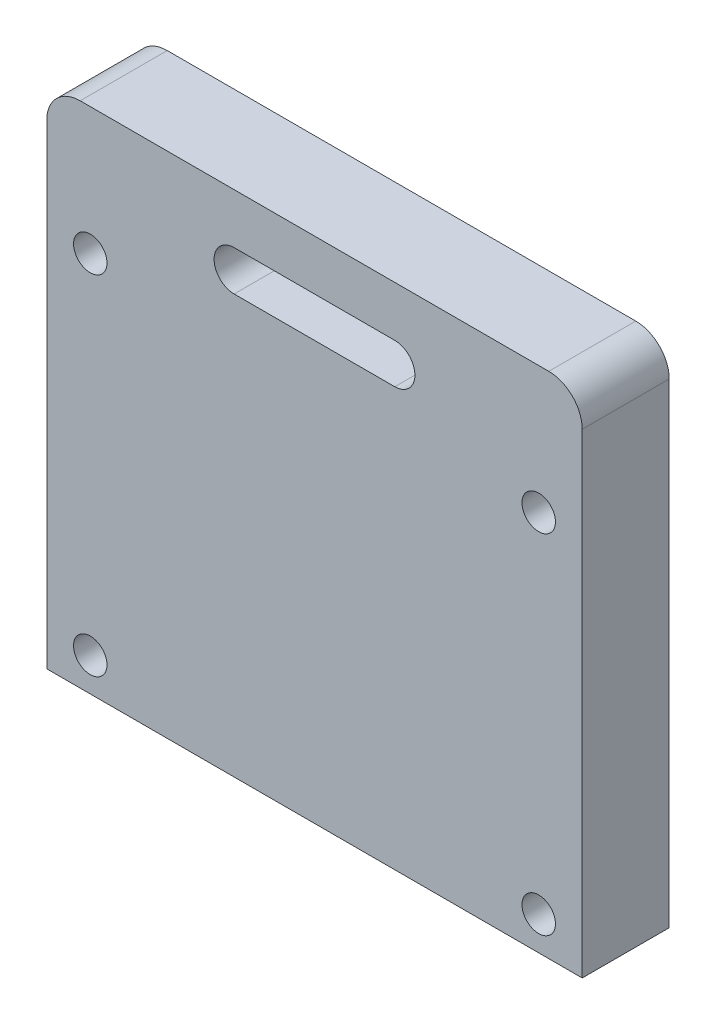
from build123d import *

# Parameters (mm, degrees)
SKIZZE1_W                       = 80
SKIZZE1_H                       = 76
LINEAR_AUSTRAGEN1_DEPTH         = 13
VERRUNDUNG1_R                   = 5
SCHNITT_LINEAR_AUSTRAGEN4_DEPTH = 87.861959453
M6_GEWINDEBOHRUNG1_D            = 5


with BuildPart() as part:
    # Skizze1 → Linear austragen1 (new body)
    with BuildSketch(Plane.XY):
        with Locations((0, 38)):
            Rectangle(SKIZZE1_W, SKIZZE1_H)
    extrude(amount=LINEAR_AUSTRAGEN1_DEPTH)

    # Verrundung1
    verrundung1_edges = [part.edges().sort_by_distance(p)[0] for p in [
        (-40, 76, 6.5),
        (40, 76, 6.5),
    ]]
    fillet(verrundung1_edges, radius=VERRUNDUNG1_R)

    # Skizze13 → Schnitt-Linear austragen4 (cut, through all)
    with BuildSketch(Plane.XY.offset(13)):
        with BuildLine():
            Line((-12, 62.5), (12, 62.5))
            ThreePointArc((12, 62.5), (15, 65.5), (12, 68.5))
            Line((12, 68.5), (-12, 68.5))
            ThreePointArc((-12, 68.5), (-15, 65.5), (-12, 62.5))
        make_face()
    extrude(amount=-SCHNITT_LINEAR_AUSTRAGEN4_DEPTH, mode=Mode.SUBTRACT)

    # M6 Gewindebohrung1 (through all)
    with Locations(Plane.XY.offset(13)):
        with Locations((-33.5, 57), (-33.5, 5), (33.5, 5), (33.5, 57)):
            Hole(M6_GEWINDEBOHRUNG1_D / 2)


solid = part.part
